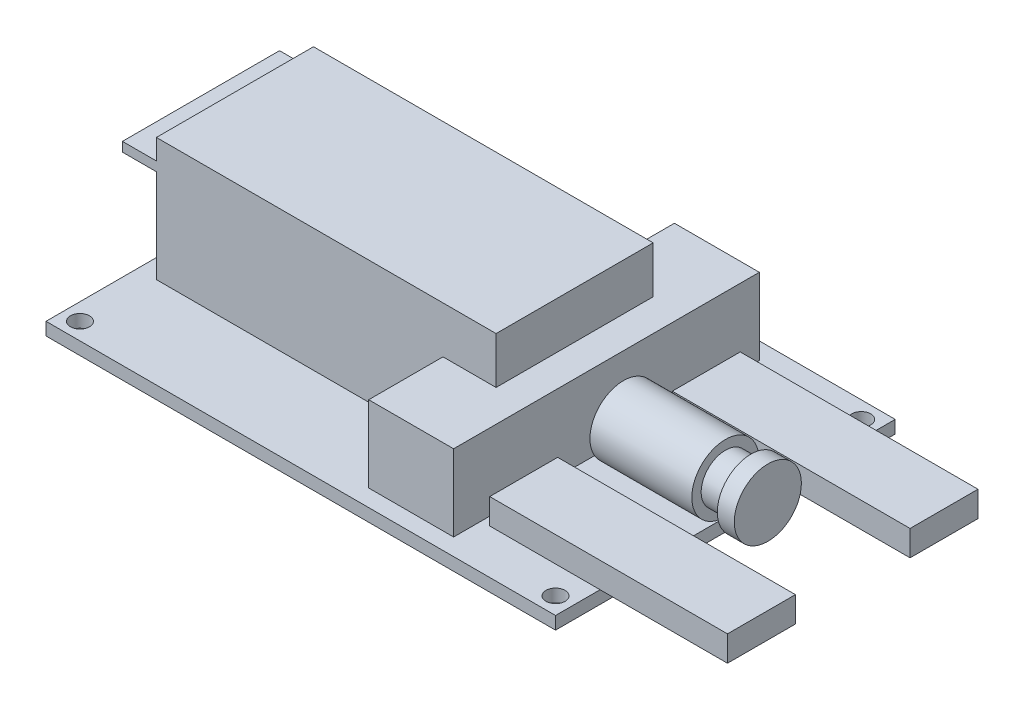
ISO-10303-21;
HEADER;
FILE_DESCRIPTION(('STEP AP214'),'2;1');
FILE_NAME('part.step','',(''),(''),'','','');
FILE_SCHEMA(('AUTOMOTIVE_DESIGN { 1 0 10303 214 1 1 1 1 }'));
ENDSEC;
DATA;
#1=APPLICATION_CONTEXT('core data for automotive mechanical design processes');
#2=APPLICATION_PROTOCOL_DEFINITION('international standard','automotive_design',2000,#1);
#3=PRODUCT_CONTEXT('',#1,'mechanical');
#4=PRODUCT('Part','Part','',(#3));
#5=PRODUCT_RELATED_PRODUCT_CATEGORY('part','',(#4));
#6=PRODUCT_DEFINITION_FORMATION('','',#4);
#7=PRODUCT_DEFINITION_CONTEXT('part definition',#1,'design');
#8=PRODUCT_DEFINITION('design','',#6,#7);
#9=PRODUCT_DEFINITION_SHAPE('','',#8);
#10=(LENGTH_UNIT() NAMED_UNIT(*) SI_UNIT(.MILLI.,.METRE.));
#11=(NAMED_UNIT(*) PLANE_ANGLE_UNIT() SI_UNIT($,.RADIAN.));
#12=(NAMED_UNIT(*) SI_UNIT($,.STERADIAN.) SOLID_ANGLE_UNIT());
#13=UNCERTAINTY_MEASURE_WITH_UNIT(LENGTH_MEASURE(1.E-05),#10,'distance_accuracy_value','');
#14=(GEOMETRIC_REPRESENTATION_CONTEXT(3) GLOBAL_UNCERTAINTY_ASSIGNED_CONTEXT((#13)) GLOBAL_UNIT_ASSIGNED_CONTEXT((#10,
#11,#12)) REPRESENTATION_CONTEXT('',''));
#15=CARTESIAN_POINT('',(0.,0.,0.));
#16=DIRECTION('',(0.,0.,1.));
#17=DIRECTION('',(1.,0.,0.));
#18=AXIS2_PLACEMENT_3D('',#15,#16,#17);
#19=CARTESIAN_POINT('',(17.,3.,-14.75));
#20=DIRECTION('',(0.,0.,-1.));
#21=DIRECTION('',(-1.,0.,0.));
#22=AXIS2_PLACEMENT_3D('',#19,#20,#21);
#23=PLANE('',#22);
#24=DIRECTION('',(1.,0.,0.));
#25=VECTOR('',#24,1.);
#26=CARTESIAN_POINT('',(17.,3.,-14.75));
#27=LINE('',#26,#25);
#28=CARTESIAN_POINT('',(17.,3.,-14.75));
#29=VERTEX_POINT('',#28);
#30=CARTESIAN_POINT('',(45.,3.,-14.75));
#31=VERTEX_POINT('',#30);
#32=EDGE_CURVE('E46',#29,#31,#27,.T.);
#33=ORIENTED_EDGE('',*,*,#32,.T.);
#34=DIRECTION('',(0.,1.,0.));
#35=VECTOR('',#34,1.);
#36=CARTESIAN_POINT('',(45.,3.,-14.75));
#37=LINE('',#36,#35);
#38=CARTESIAN_POINT('',(45.,0.,-14.75));
#39=VERTEX_POINT('',#38);
#40=EDGE_CURVE('E83',#39,#31,#37,.T.);
#41=ORIENTED_EDGE('',*,*,#40,.F.);
#42=DIRECTION('',(1.,0.,0.));
#43=VECTOR('',#42,1.);
#44=CARTESIAN_POINT('',(17.,0.,-14.75));
#45=LINE('',#44,#43);
#46=CARTESIAN_POINT('',(17.,0.,-14.75));
#47=VERTEX_POINT('',#46);
#48=EDGE_CURVE('E12',#47,#39,#45,.T.);
#49=ORIENTED_EDGE('',*,*,#48,.F.);
#50=DIRECTION('',(0.,1.,0.));
#51=VECTOR('',#50,1.);
#52=CARTESIAN_POINT('',(17.,3.,-14.75));
#53=LINE('',#52,#51);
#54=EDGE_CURVE('E84',#47,#29,#53,.T.);
#55=ORIENTED_EDGE('',*,*,#54,.T.);
#56=EDGE_LOOP('',(#33,#41,#49,#55));
#57=FACE_BOUND('',#56,.T.);
#58=ADVANCED_FACE('F43',(#57),#23,.T.);
#59=CARTESIAN_POINT('',(17.,0.,-14.75));
#60=DIRECTION('',(0.,-1.,0.));
#61=DIRECTION('',(0.,0.,-1.));
#62=AXIS2_PLACEMENT_3D('',#59,#60,#61);
#63=PLANE('',#62);
#64=ORIENTED_EDGE('',*,*,#48,.T.);
#65=DIRECTION('',(0.,0.,-1.));
#66=VECTOR('',#65,1.);
#67=CARTESIAN_POINT('',(45.,0.,-14.75));
#68=LINE('',#67,#66);
#69=CARTESIAN_POINT('',(45.,0.,-6.75));
#70=VERTEX_POINT('',#69);
#71=EDGE_CURVE('E100',#70,#39,#68,.T.);
#72=ORIENTED_EDGE('',*,*,#71,.F.);
#73=DIRECTION('',(1.,0.,0.));
#74=VECTOR('',#73,1.);
#75=CARTESIAN_POINT('',(17.,0.,-6.75));
#76=LINE('',#75,#74);
#77=CARTESIAN_POINT('',(17.,0.,-6.75));
#78=VERTEX_POINT('',#77);
#79=EDGE_CURVE('E51',#78,#70,#76,.T.);
#80=ORIENTED_EDGE('',*,*,#79,.F.);
#81=DIRECTION('',(0.,0.,-1.));
#82=VECTOR('',#81,1.);
#83=CARTESIAN_POINT('',(17.,0.,-14.75));
#84=LINE('',#83,#82);
#85=EDGE_CURVE('E89',#78,#47,#84,.T.);
#86=ORIENTED_EDGE('',*,*,#85,.T.);
#87=EDGE_LOOP('',(#64,#72,#80,#86));
#88=FACE_BOUND('',#87,.T.);
#89=ADVANCED_FACE('F115',(#88),#63,.T.);
#90=CARTESIAN_POINT('',(17.,3.,-6.75));
#91=DIRECTION('',(0.,0.,1.));
#92=DIRECTION('',(1.,0.,0.));
#93=AXIS2_PLACEMENT_3D('',#90,#91,#92);
#94=PLANE('',#93);
#95=ORIENTED_EDGE('',*,*,#79,.T.);
#96=DIRECTION('',(0.,-1.,0.));
#97=VECTOR('',#96,1.);
#98=CARTESIAN_POINT('',(45.,3.,-6.75));
#99=LINE('',#98,#97);
#100=CARTESIAN_POINT('',(45.,3.,-6.75));
#101=VERTEX_POINT('',#100);
#102=EDGE_CURVE('E96',#101,#70,#99,.T.);
#103=ORIENTED_EDGE('',*,*,#102,.F.);
#104=DIRECTION('',(1.,0.,0.));
#105=VECTOR('',#104,1.);
#106=CARTESIAN_POINT('',(17.,3.,-6.75));
#107=LINE('',#106,#105);
#108=CARTESIAN_POINT('',(17.,3.,-6.75));
#109=VERTEX_POINT('',#108);
#110=EDGE_CURVE('E88',#109,#101,#107,.T.);
#111=ORIENTED_EDGE('',*,*,#110,.F.);
#112=DIRECTION('',(0.,-1.,0.));
#113=VECTOR('',#112,1.);
#114=CARTESIAN_POINT('',(17.,3.,-6.75));
#115=LINE('',#114,#113);
#116=EDGE_CURVE('E108',#109,#78,#115,.T.);
#117=ORIENTED_EDGE('',*,*,#116,.T.);
#118=EDGE_LOOP('',(#95,#103,#111,#117));
#119=FACE_BOUND('',#118,.T.);
#120=ADVANCED_FACE('F112',(#119),#94,.T.);
#121=CARTESIAN_POINT('',(17.,3.,-14.75));
#122=DIRECTION('',(0.,1.,0.));
#123=DIRECTION('',(0.,0.,1.));
#124=AXIS2_PLACEMENT_3D('',#121,#122,#123);
#125=PLANE('',#124);
#126=ORIENTED_EDGE('',*,*,#110,.T.);
#127=DIRECTION('',(0.,0.,1.));
#128=VECTOR('',#127,1.);
#129=CARTESIAN_POINT('',(45.,3.,-14.75));
#130=LINE('',#129,#128);
#131=EDGE_CURVE('E91',#31,#101,#130,.T.);
#132=ORIENTED_EDGE('',*,*,#131,.F.);
#133=ORIENTED_EDGE('',*,*,#32,.F.);
#134=DIRECTION('',(0.,0.,1.));
#135=VECTOR('',#134,1.);
#136=CARTESIAN_POINT('',(17.,3.,-14.75));
#137=LINE('',#136,#135);
#138=EDGE_CURVE('E106',#29,#109,#137,.T.);
#139=ORIENTED_EDGE('',*,*,#138,.T.);
#140=EDGE_LOOP('',(#126,#132,#133,#139));
#141=FACE_BOUND('',#140,.T.);
#142=ADVANCED_FACE('F92',(#141),#125,.T.);
#143=CARTESIAN_POINT('',(17.,0.,0.));
#144=DIRECTION('',(-1.,0.,0.));
#145=DIRECTION('',(0.,0.,1.));
#146=AXIS2_PLACEMENT_3D('',#143,#144,#145);
#147=PLANE('',#146);
#148=ORIENTED_EDGE('',*,*,#54,.F.);
#149=ORIENTED_EDGE('',*,*,#85,.F.);
#150=ORIENTED_EDGE('',*,*,#116,.F.);
#151=ORIENTED_EDGE('',*,*,#138,.F.);
#152=EDGE_LOOP('',(#148,#149,#150,#151));
#153=FACE_BOUND('',#152,.T.);
#154=ADVANCED_FACE('F117',(#153),#147,.T.);
#155=CARTESIAN_POINT('',(45.,0.,0.));
#156=DIRECTION('',(-1.,0.,0.));
#157=DIRECTION('',(0.,0.,1.));
#158=AXIS2_PLACEMENT_3D('',#155,#156,#157);
#159=PLANE('',#158);
#160=ORIENTED_EDGE('',*,*,#40,.T.);
#161=ORIENTED_EDGE('',*,*,#131,.T.);
#162=ORIENTED_EDGE('',*,*,#102,.T.);
#163=ORIENTED_EDGE('',*,*,#71,.T.);
#164=EDGE_LOOP('',(#160,#161,#162,#163));
#165=FACE_BOUND('',#164,.T.);
#166=ADVANCED_FACE('F99',(#165),#159,.F.);
#167=CLOSED_SHELL('',(#58,#89,#120,#142,#154,#166));
#168=MANIFOLD_SOLID_BREP('B2',#167);
#169=CARTESIAN_POINT('',(17.,3.,14.75));
#170=DIRECTION('',(0.,0.,1.));
#171=DIRECTION('',(1.,0.,0.));
#172=AXIS2_PLACEMENT_3D('',#169,#170,#171);
#173=PLANE('',#172);
#174=DIRECTION('',(1.,0.,0.));
#175=VECTOR('',#174,1.);
#176=CARTESIAN_POINT('',(17.,0.,14.75));
#177=LINE('',#176,#175);
#178=CARTESIAN_POINT('',(17.,0.,14.75));
#179=VERTEX_POINT('',#178);
#180=CARTESIAN_POINT('',(45.,0.,14.75));
#181=VERTEX_POINT('',#180);
#182=EDGE_CURVE('E177',#179,#181,#177,.T.);
#183=ORIENTED_EDGE('',*,*,#182,.T.);
#184=DIRECTION('',(0.,-1.,0.));
#185=VECTOR('',#184,1.);
#186=CARTESIAN_POINT('',(45.,3.,14.75));
#187=LINE('',#186,#185);
#188=CARTESIAN_POINT('',(45.,3.,14.75));
#189=VERTEX_POINT('',#188);
#190=EDGE_CURVE('E214',#189,#181,#187,.T.);
#191=ORIENTED_EDGE('',*,*,#190,.F.);
#192=DIRECTION('',(1.,0.,0.));
#193=VECTOR('',#192,1.);
#194=CARTESIAN_POINT('',(17.,3.,14.75));
#195=LINE('',#194,#193);
#196=CARTESIAN_POINT('',(17.,3.,14.75));
#197=VERTEX_POINT('',#196);
#198=EDGE_CURVE('E41',#197,#189,#195,.T.);
#199=ORIENTED_EDGE('',*,*,#198,.F.);
#200=DIRECTION('',(0.,-1.,0.));
#201=VECTOR('',#200,1.);
#202=CARTESIAN_POINT('',(17.,3.,14.75));
#203=LINE('',#202,#201);
#204=EDGE_CURVE('E215',#197,#179,#203,.T.);
#205=ORIENTED_EDGE('',*,*,#204,.T.);
#206=EDGE_LOOP('',(#183,#191,#199,#205));
#207=FACE_BOUND('',#206,.T.);
#208=ADVANCED_FACE('F174',(#207),#173,.T.);
#209=CARTESIAN_POINT('',(17.,3.,14.75));
#210=DIRECTION('',(0.,1.,0.));
#211=DIRECTION('',(0.,0.,1.));
#212=AXIS2_PLACEMENT_3D('',#209,#210,#211);
#213=PLANE('',#212);
#214=ORIENTED_EDGE('',*,*,#198,.T.);
#215=DIRECTION('',(0.,0.,1.));
#216=VECTOR('',#215,1.);
#217=CARTESIAN_POINT('',(45.,3.,14.75));
#218=LINE('',#217,#216);
#219=CARTESIAN_POINT('',(45.,3.,6.75));
#220=VERTEX_POINT('',#219);
#221=EDGE_CURVE('E231',#220,#189,#218,.T.);
#222=ORIENTED_EDGE('',*,*,#221,.F.);
#223=DIRECTION('',(1.,0.,0.));
#224=VECTOR('',#223,1.);
#225=CARTESIAN_POINT('',(17.,3.,6.75));
#226=LINE('',#225,#224);
#227=CARTESIAN_POINT('',(17.,3.,6.75));
#228=VERTEX_POINT('',#227);
#229=EDGE_CURVE('E182',#228,#220,#226,.T.);
#230=ORIENTED_EDGE('',*,*,#229,.F.);
#231=DIRECTION('',(0.,0.,1.));
#232=VECTOR('',#231,1.);
#233=CARTESIAN_POINT('',(17.,3.,14.75));
#234=LINE('',#233,#232);
#235=EDGE_CURVE('E220',#228,#197,#234,.T.);
#236=ORIENTED_EDGE('',*,*,#235,.T.);
#237=EDGE_LOOP('',(#214,#222,#230,#236));
#238=FACE_BOUND('',#237,.T.);
#239=ADVANCED_FACE('F246',(#238),#213,.T.);
#240=CARTESIAN_POINT('',(17.,3.,6.75));
#241=DIRECTION('',(0.,0.,-1.));
#242=DIRECTION('',(-1.,0.,0.));
#243=AXIS2_PLACEMENT_3D('',#240,#241,#242);
#244=PLANE('',#243);
#245=ORIENTED_EDGE('',*,*,#229,.T.);
#246=DIRECTION('',(0.,1.,0.));
#247=VECTOR('',#246,1.);
#248=CARTESIAN_POINT('',(45.,3.,6.75));
#249=LINE('',#248,#247);
#250=CARTESIAN_POINT('',(45.,0.,6.75));
#251=VERTEX_POINT('',#250);
#252=EDGE_CURVE('E227',#251,#220,#249,.T.);
#253=ORIENTED_EDGE('',*,*,#252,.F.);
#254=DIRECTION('',(1.,0.,0.));
#255=VECTOR('',#254,1.);
#256=CARTESIAN_POINT('',(17.,0.,6.75));
#257=LINE('',#256,#255);
#258=CARTESIAN_POINT('',(17.,0.,6.75));
#259=VERTEX_POINT('',#258);
#260=EDGE_CURVE('E219',#259,#251,#257,.T.);
#261=ORIENTED_EDGE('',*,*,#260,.F.);
#262=DIRECTION('',(0.,1.,0.));
#263=VECTOR('',#262,1.);
#264=CARTESIAN_POINT('',(17.,3.,6.75));
#265=LINE('',#264,#263);
#266=EDGE_CURVE('E239',#259,#228,#265,.T.);
#267=ORIENTED_EDGE('',*,*,#266,.T.);
#268=EDGE_LOOP('',(#245,#253,#261,#267));
#269=FACE_BOUND('',#268,.T.);
#270=ADVANCED_FACE('F243',(#269),#244,.T.);
#271=CARTESIAN_POINT('',(17.,0.,14.75));
#272=DIRECTION('',(0.,-1.,0.));
#273=DIRECTION('',(0.,0.,-1.));
#274=AXIS2_PLACEMENT_3D('',#271,#272,#273);
#275=PLANE('',#274);
#276=ORIENTED_EDGE('',*,*,#260,.T.);
#277=DIRECTION('',(0.,0.,-1.));
#278=VECTOR('',#277,1.);
#279=CARTESIAN_POINT('',(45.,0.,14.75));
#280=LINE('',#279,#278);
#281=EDGE_CURVE('E222',#181,#251,#280,.T.);
#282=ORIENTED_EDGE('',*,*,#281,.F.);
#283=ORIENTED_EDGE('',*,*,#182,.F.);
#284=DIRECTION('',(0.,0.,-1.));
#285=VECTOR('',#284,1.);
#286=CARTESIAN_POINT('',(17.,0.,14.75));
#287=LINE('',#286,#285);
#288=EDGE_CURVE('E237',#179,#259,#287,.T.);
#289=ORIENTED_EDGE('',*,*,#288,.T.);
#290=EDGE_LOOP('',(#276,#282,#283,#289));
#291=FACE_BOUND('',#290,.T.);
#292=ADVANCED_FACE('F223',(#291),#275,.T.);
#293=CARTESIAN_POINT('',(17.,0.,0.));
#294=DIRECTION('',(1.,0.,0.));
#295=DIRECTION('',(0.,0.,-1.));
#296=AXIS2_PLACEMENT_3D('',#293,#294,#295);
#297=PLANE('',#296);
#298=ORIENTED_EDGE('',*,*,#204,.F.);
#299=ORIENTED_EDGE('',*,*,#235,.F.);
#300=ORIENTED_EDGE('',*,*,#266,.F.);
#301=ORIENTED_EDGE('',*,*,#288,.F.);
#302=EDGE_LOOP('',(#298,#299,#300,#301));
#303=FACE_BOUND('',#302,.T.);
#304=ADVANCED_FACE('F248',(#303),#297,.F.);
#305=CARTESIAN_POINT('',(45.,0.,0.));
#306=DIRECTION('',(1.,0.,0.));
#307=DIRECTION('',(0.,0.,-1.));
#308=AXIS2_PLACEMENT_3D('',#305,#306,#307);
#309=PLANE('',#308);
#310=ORIENTED_EDGE('',*,*,#190,.T.);
#311=ORIENTED_EDGE('',*,*,#281,.T.);
#312=ORIENTED_EDGE('',*,*,#252,.T.);
#313=ORIENTED_EDGE('',*,*,#221,.T.);
#314=EDGE_LOOP('',(#310,#311,#312,#313));
#315=FACE_BOUND('',#314,.T.);
#316=ADVANCED_FACE('F230',(#315),#309,.T.);
#317=CLOSED_SHELL('',(#208,#239,#270,#292,#304,#316));
#318=MANIFOLD_SOLID_BREP('B6',#317);
#319=CARTESIAN_POINT('',(35.,4.,0.));
#320=DIRECTION('',(-1.,0.,0.));
#321=DIRECTION('',(0.,0.,1.));
#322=AXIS2_PLACEMENT_3D('',#319,#320,#321);
#323=CYLINDRICAL_SURFACE('',#322,3.95);
#324=CARTESIAN_POINT('',(35.,4.,0.));
#325=DIRECTION('',(1.,0.,0.));
#326=DIRECTION('',(0.,0.,-1.));
#327=AXIS2_PLACEMENT_3D('',#324,#325,#326);
#328=CIRCLE('',#327,3.95);
#329=CARTESIAN_POINT('',(35.,4.,-3.95));
#330=VERTEX_POINT('',#329);
#331=EDGE_CURVE('E173',#330,#330,#328,.T.);
#332=ORIENTED_EDGE('',*,*,#331,.F.);
#333=EDGE_LOOP('',(#332));
#334=FACE_BOUND('',#333,.T.);
#335=CARTESIAN_POINT('',(33.,4.,0.));
#336=DIRECTION('',(1.,0.,0.));
#337=DIRECTION('',(0.,0.,-1.));
#338=AXIS2_PLACEMENT_3D('',#335,#336,#337);
#339=CIRCLE('',#338,3.95);
#340=CARTESIAN_POINT('',(33.,4.,-3.95));
#341=VERTEX_POINT('',#340);
#342=EDGE_CURVE('E308',#341,#341,#339,.T.);
#343=ORIENTED_EDGE('',*,*,#342,.T.);
#344=EDGE_LOOP('',(#343));
#345=FACE_BOUND('',#344,.T.);
#346=ADVANCED_FACE('F305',(#334,#345),#323,.T.);
#347=CARTESIAN_POINT('',(35.,4.,0.));
#348=DIRECTION('',(1.,0.,0.));
#349=DIRECTION('',(0.,0.,-1.));
#350=AXIS2_PLACEMENT_3D('',#347,#348,#349);
#351=PLANE('',#350);
#352=ORIENTED_EDGE('',*,*,#331,.T.);
#353=EDGE_LOOP('',(#352));
#354=FACE_BOUND('',#353,.T.);
#355=ADVANCED_FACE('F320',(#354),#351,.T.);
#356=CARTESIAN_POINT('',(33.,4.,0.));
#357=DIRECTION('',(1.,0.,0.));
#358=DIRECTION('',(0.,0.,-1.));
#359=AXIS2_PLACEMENT_3D('',#356,#357,#358);
#360=PLANE('',#359);
#361=ORIENTED_EDGE('',*,*,#342,.F.);
#362=EDGE_LOOP('',(#361));
#363=FACE_BOUND('',#362,.T.);
#364=ADVANCED_FACE('F318',(#363),#360,.F.);
#365=CLOSED_SHELL('',(#346,#355,#364));
#366=MANIFOLD_SOLID_BREP('B35',#365);
#367=CARTESIAN_POINT('',(33.,4.,0.));
#368=DIRECTION('',(-1.,0.,0.));
#369=DIRECTION('',(0.,0.,1.));
#370=AXIS2_PLACEMENT_3D('',#367,#368,#369);
#371=CYLINDRICAL_SURFACE('',#370,2.85);
#372=CARTESIAN_POINT('',(33.,4.,0.));
#373=DIRECTION('',(1.,0.,0.));
#374=DIRECTION('',(0.,0.,-1.));
#375=AXIS2_PLACEMENT_3D('',#372,#373,#374);
#376=CIRCLE('',#375,2.85);
#377=CARTESIAN_POINT('',(33.,4.,-2.85));
#378=VERTEX_POINT('',#377);
#379=EDGE_CURVE('E304',#378,#378,#376,.T.);
#380=ORIENTED_EDGE('',*,*,#379,.F.);
#381=EDGE_LOOP('',(#380));
#382=FACE_BOUND('',#381,.T.);
#383=CARTESIAN_POINT('',(30.,4.,0.));
#384=DIRECTION('',(1.,0.,0.));
#385=DIRECTION('',(0.,0.,-1.));
#386=AXIS2_PLACEMENT_3D('',#383,#384,#385);
#387=CIRCLE('',#386,2.85);
#388=CARTESIAN_POINT('',(30.,4.,-2.85));
#389=VERTEX_POINT('',#388);
#390=EDGE_CURVE('E356',#389,#389,#387,.T.);
#391=ORIENTED_EDGE('',*,*,#390,.T.);
#392=EDGE_LOOP('',(#391));
#393=FACE_BOUND('',#392,.T.);
#394=ADVANCED_FACE('F353',(#382,#393),#371,.T.);
#395=CARTESIAN_POINT('',(33.,4.,0.));
#396=DIRECTION('',(1.,0.,0.));
#397=DIRECTION('',(0.,0.,-1.));
#398=AXIS2_PLACEMENT_3D('',#395,#396,#397);
#399=PLANE('',#398);
#400=ORIENTED_EDGE('',*,*,#379,.T.);
#401=EDGE_LOOP('',(#400));
#402=FACE_BOUND('',#401,.T.);
#403=ADVANCED_FACE('F368',(#402),#399,.T.);
#404=CARTESIAN_POINT('',(30.,4.,0.));
#405=DIRECTION('',(1.,0.,0.));
#406=DIRECTION('',(0.,0.,-1.));
#407=AXIS2_PLACEMENT_3D('',#404,#405,#406);
#408=PLANE('',#407);
#409=ORIENTED_EDGE('',*,*,#390,.F.);
#410=EDGE_LOOP('',(#409));
#411=FACE_BOUND('',#410,.T.);
#412=ADVANCED_FACE('F366',(#411),#408,.F.);
#413=CLOSED_SHELL('',(#394,#403,#412));
#414=MANIFOLD_SOLID_BREP('B168',#413);
#415=CARTESIAN_POINT('',(18.,4.,0.));
#416=DIRECTION('',(1.,0.,0.));
#417=DIRECTION('',(0.,0.,-1.));
#418=AXIS2_PLACEMENT_3D('',#415,#416,#417);
#419=CYLINDRICAL_SURFACE('',#418,3.95);
#420=CARTESIAN_POINT('',(18.,4.,0.));
#421=DIRECTION('',(1.,0.,0.));
#422=DIRECTION('',(0.,0.,-1.));
#423=AXIS2_PLACEMENT_3D('',#420,#421,#422);
#424=CIRCLE('',#423,3.95);
#425=CARTESIAN_POINT('',(18.,4.,-3.95));
#426=VERTEX_POINT('',#425);
#427=EDGE_CURVE('E352',#426,#426,#424,.T.);
#428=ORIENTED_EDGE('',*,*,#427,.T.);
#429=EDGE_LOOP('',(#428));
#430=FACE_BOUND('',#429,.T.);
#431=CARTESIAN_POINT('',(30.,4.,0.));
#432=DIRECTION('',(1.,0.,0.));
#433=DIRECTION('',(0.,0.,-1.));
#434=AXIS2_PLACEMENT_3D('',#431,#432,#433);
#435=CIRCLE('',#434,3.95);
#436=CARTESIAN_POINT('',(30.,4.,-3.95));
#437=VERTEX_POINT('',#436);
#438=EDGE_CURVE('E405',#437,#437,#435,.T.);
#439=ORIENTED_EDGE('',*,*,#438,.F.);
#440=EDGE_LOOP('',(#439));
#441=FACE_BOUND('',#440,.T.);
#442=ADVANCED_FACE('F402',(#430,#441),#419,.T.);
#443=CARTESIAN_POINT('',(18.,4.,0.));
#444=DIRECTION('',(1.,0.,0.));
#445=DIRECTION('',(0.,0.,-1.));
#446=AXIS2_PLACEMENT_3D('',#443,#444,#445);
#447=PLANE('',#446);
#448=ORIENTED_EDGE('',*,*,#427,.F.);
#449=EDGE_LOOP('',(#448));
#450=FACE_BOUND('',#449,.T.);
#451=ADVANCED_FACE('F417',(#450),#447,.F.);
#452=CARTESIAN_POINT('',(30.,4.,0.));
#453=DIRECTION('',(1.,0.,0.));
#454=DIRECTION('',(0.,0.,-1.));
#455=AXIS2_PLACEMENT_3D('',#452,#453,#454);
#456=PLANE('',#455);
#457=ORIENTED_EDGE('',*,*,#438,.T.);
#458=EDGE_LOOP('',(#457));
#459=FACE_BOUND('',#458,.T.);
#460=ADVANCED_FACE('F414',(#459),#456,.T.);
#461=CLOSED_SHELL('',(#442,#451,#460));
#462=MANIFOLD_SOLID_BREP('B299',#461);
#463=CARTESIAN_POINT('',(0.,14.5,0.));
#464=DIRECTION('',(0.,1.,0.));
#465=DIRECTION('',(0.,0.,1.));
#466=AXIS2_PLACEMENT_3D('',#463,#464,#465);
#467=PLANE('',#466);
#468=DIRECTION('',(-1.,0.,0.));
#469=VECTOR('',#468,1.);
#470=CARTESIAN_POINT('',(-31.75,14.5,-9.25));
#471=LINE('',#470,#469);
#472=CARTESIAN_POINT('',(12.25,14.5,-9.25));
#473=VERTEX_POINT('',#472);
#474=CARTESIAN_POINT('',(-27.75,14.5,-9.25));
#475=VERTEX_POINT('',#474);
#476=EDGE_CURVE('E617',#473,#475,#471,.T.);
#477=ORIENTED_EDGE('',*,*,#476,.T.);
#478=DIRECTION('',(0.,0.,-1.));
#479=VECTOR('',#478,1.);
#480=CARTESIAN_POINT('',(-27.75,14.5,-9.25));
#481=LINE('',#480,#479);
#482=CARTESIAN_POINT('',(-27.75,14.5,9.25));
#483=VERTEX_POINT('',#482);
#484=EDGE_CURVE('E579',#483,#475,#481,.T.);
#485=ORIENTED_EDGE('',*,*,#484,.F.);
#486=DIRECTION('',(1.,0.,0.));
#487=VECTOR('',#486,1.);
#488=CARTESIAN_POINT('',(-31.75,14.5,9.25));
#489=LINE('',#488,#487);
#490=CARTESIAN_POINT('',(12.25,14.5,9.24999999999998));
#491=VERTEX_POINT('',#490);
#492=EDGE_CURVE('E612',#483,#491,#489,.T.);
#493=ORIENTED_EDGE('',*,*,#492,.T.);
#494=DIRECTION('',(0.,0.,-1.));
#495=VECTOR('',#494,1.);
#496=CARTESIAN_POINT('',(12.25,14.5,-9.25));
#497=LINE('',#496,#495);
#498=EDGE_CURVE('E614',#491,#473,#497,.T.);
#499=ORIENTED_EDGE('',*,*,#498,.T.);
#500=EDGE_LOOP('',(#477,#485,#493,#499));
#501=FACE_BOUND('',#500,.T.);
#502=ADVANCED_FACE('F442',(#501),#467,.T.);
#503=CARTESIAN_POINT('',(0.,0.,0.));
#504=DIRECTION('',(0.,-1.,0.));
#505=DIRECTION('',(0.,0.,-1.));
#506=AXIS2_PLACEMENT_3D('',#503,#504,#505);
#507=PLANE('',#506);
#508=DIRECTION('',(1.,0.,0.));
#509=VECTOR('',#508,1.);
#510=CARTESIAN_POINT('',(-31.75,0.,9.25));
#511=LINE('',#510,#509);
#512=CARTESIAN_POINT('',(-27.75,0.,9.25));
#513=VERTEX_POINT('',#512);
#514=CARTESIAN_POINT('',(6.00000000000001,0.,9.24999999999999));
#515=VERTEX_POINT('',#514);
#516=EDGE_CURVE('E610',#513,#515,#511,.T.);
#517=ORIENTED_EDGE('',*,*,#516,.F.);
#518=DIRECTION('',(0.,0.,1.));
#519=VECTOR('',#518,1.);
#520=CARTESIAN_POINT('',(-27.75,0.,-9.25));
#521=LINE('',#520,#519);
#522=CARTESIAN_POINT('',(-27.75,0.,-9.25));
#523=VERTEX_POINT('',#522);
#524=EDGE_CURVE('E598',#523,#513,#521,.T.);
#525=ORIENTED_EDGE('',*,*,#524,.F.);
#526=DIRECTION('',(-1.,0.,0.));
#527=VECTOR('',#526,1.);
#528=CARTESIAN_POINT('',(-31.75,0.,-9.25));
#529=LINE('',#528,#527);
#530=CARTESIAN_POINT('',(6.,0.,-9.25));
#531=VERTEX_POINT('',#530);
#532=EDGE_CURVE('E615',#531,#523,#529,.T.);
#533=ORIENTED_EDGE('',*,*,#532,.F.);
#534=DIRECTION('',(0.,0.,1.));
#535=VECTOR('',#534,1.);
#536=CARTESIAN_POINT('',(6.,0.,-18.));
#537=LINE('',#536,#535);
#538=CARTESIAN_POINT('',(6.,0.,-18.));
#539=VERTEX_POINT('',#538);
#540=EDGE_CURVE('E645',#539,#531,#537,.T.);
#541=ORIENTED_EDGE('',*,*,#540,.F.);
#542=DIRECTION('',(-1.,0.,0.));
#543=VECTOR('',#542,1.);
#544=CARTESIAN_POINT('',(6.,0.,-18.));
#545=LINE('',#544,#543);
#546=CARTESIAN_POINT('',(16.,0.,-18.));
#547=VERTEX_POINT('',#546);
#548=EDGE_CURVE('E654',#547,#539,#545,.T.);
#549=ORIENTED_EDGE('',*,*,#548,.F.);
#550=DIRECTION('',(0.,0.,-1.));
#551=VECTOR('',#550,1.);
#552=CARTESIAN_POINT('',(16.,0.,-18.));
#553=LINE('',#552,#551);
#554=CARTESIAN_POINT('',(16.,0.,18.));
#555=VERTEX_POINT('',#554);
#556=EDGE_CURVE('E651',#555,#547,#553,.T.);
#557=ORIENTED_EDGE('',*,*,#556,.F.);
#558=DIRECTION('',(1.,0.,0.));
#559=VECTOR('',#558,1.);
#560=CARTESIAN_POINT('',(6.,0.,18.));
#561=LINE('',#560,#559);
#562=CARTESIAN_POINT('',(6.,0.,18.));
#563=VERTEX_POINT('',#562);
#564=EDGE_CURVE('E648',#563,#555,#561,.T.);
#565=ORIENTED_EDGE('',*,*,#564,.F.);
#566=EDGE_CURVE('E633',#515,#563,#537,.T.);
#567=ORIENTED_EDGE('',*,*,#566,.F.);
#568=EDGE_LOOP('',(#517,#525,#533,#541,#549,#557,#565,#567));
#569=FACE_BOUND('',#568,.T.);
#570=CARTESIAN_POINT('',(28.,0.,18.));
#571=DIRECTION('',(0.,1.,0.));
#572=DIRECTION('',(0.,0.,1.));
#573=AXIS2_PLACEMENT_3D('',#570,#571,#572);
#574=CIRCLE('',#573,1.125);
#575=CARTESIAN_POINT('',(28.,0.,19.125));
#576=VERTEX_POINT('',#575);
#577=EDGE_CURVE('E668',#576,#576,#574,.T.);
#578=ORIENTED_EDGE('',*,*,#577,.F.);
#579=EDGE_LOOP('',(#578));
#580=FACE_BOUND('',#579,.T.);
#581=CARTESIAN_POINT('',(-28.,0.,18.));
#582=DIRECTION('',(0.,1.,0.));
#583=DIRECTION('',(0.,0.,-1.));
#584=AXIS2_PLACEMENT_3D('',#581,#582,#583);
#585=CIRCLE('',#584,1.125);
#586=CARTESIAN_POINT('',(-28.,0.,16.875));
#587=VERTEX_POINT('',#586);
#588=EDGE_CURVE('E672',#587,#587,#585,.T.);
#589=ORIENTED_EDGE('',*,*,#588,.F.);
#590=EDGE_LOOP('',(#589));
#591=FACE_BOUND('',#590,.T.);
#592=CARTESIAN_POINT('',(28.,0.,-18.));
#593=DIRECTION('',(0.,1.,0.));
#594=DIRECTION('',(0.,0.,-1.));
#595=AXIS2_PLACEMENT_3D('',#592,#593,#594);
#596=CIRCLE('',#595,1.125);
#597=CARTESIAN_POINT('',(28.,0.,-19.125));
#598=VERTEX_POINT('',#597);
#599=EDGE_CURVE('E678',#598,#598,#596,.T.);
#600=ORIENTED_EDGE('',*,*,#599,.F.);
#601=EDGE_LOOP('',(#600));
#602=FACE_BOUND('',#601,.T.);
#603=CARTESIAN_POINT('',(-28.,0.,-18.));
#604=DIRECTION('',(0.,1.,0.));
#605=DIRECTION('',(0.,0.,1.));
#606=AXIS2_PLACEMENT_3D('',#603,#604,#605);
#607=CIRCLE('',#606,1.125);
#608=CARTESIAN_POINT('',(-28.,0.,-16.875));
#609=VERTEX_POINT('',#608);
#610=EDGE_CURVE('E684',#609,#609,#607,.T.);
#611=ORIENTED_EDGE('',*,*,#610,.F.);
#612=EDGE_LOOP('',(#611));
#613=FACE_BOUND('',#612,.T.);
#614=DIRECTION('',(0.,0.,1.));
#615=VECTOR('',#614,1.);
#616=CARTESIAN_POINT('',(-30.,0.,20.));
#617=LINE('',#616,#615);
#618=CARTESIAN_POINT('',(-30.,0.,-20.));
#619=VERTEX_POINT('',#618);
#620=CARTESIAN_POINT('',(-30.,0.,20.));
#621=VERTEX_POINT('',#620);
#622=EDGE_CURVE('E712',#619,#621,#617,.T.);
#623=ORIENTED_EDGE('',*,*,#622,.T.);
#624=DIRECTION('',(1.,0.,0.));
#625=VECTOR('',#624,1.);
#626=CARTESIAN_POINT('',(-30.,0.,20.));
#627=LINE('',#626,#625);
#628=CARTESIAN_POINT('',(30.,0.,20.));
#629=VERTEX_POINT('',#628);
#630=EDGE_CURVE('E697',#621,#629,#627,.T.);
#631=ORIENTED_EDGE('',*,*,#630,.T.);
#632=DIRECTION('',(0.,0.,-1.));
#633=VECTOR('',#632,1.);
#634=CARTESIAN_POINT('',(30.,0.,20.));
#635=LINE('',#634,#633);
#636=CARTESIAN_POINT('',(30.,0.,-20.));
#637=VERTEX_POINT('',#636);
#638=EDGE_CURVE('E690',#629,#637,#635,.T.);
#639=ORIENTED_EDGE('',*,*,#638,.T.);
#640=DIRECTION('',(-1.,0.,0.));
#641=VECTOR('',#640,1.);
#642=CARTESIAN_POINT('',(-30.,0.,-20.));
#643=LINE('',#642,#641);
#644=EDGE_CURVE('E709',#637,#619,#643,.T.);
#645=ORIENTED_EDGE('',*,*,#644,.T.);
#646=EDGE_LOOP('',(#623,#631,#639,#645));
#647=FACE_BOUND('',#646,.T.);
#648=ADVANCED_FACE('F747',(#569,#580,#591,#602,#613,#647),#507,.F.);
#649=CARTESIAN_POINT('',(6.,9.,-18.));
#650=DIRECTION('',(1.,0.,0.));
#651=DIRECTION('',(0.,0.,-1.));
#652=AXIS2_PLACEMENT_3D('',#649,#650,#651);
#653=PLANE('',#652);
#654=DIRECTION('',(0.,1.,0.));
#655=VECTOR('',#654,1.);
#656=CARTESIAN_POINT('',(6.,9.,9.24999999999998));
#657=LINE('',#656,#655);
#658=CARTESIAN_POINT('',(6.,9.,9.24999999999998));
#659=VERTEX_POINT('',#658);
#660=EDGE_CURVE('E631',#515,#659,#657,.T.);
#661=ORIENTED_EDGE('',*,*,#660,.F.);
#662=ORIENTED_EDGE('',*,*,#566,.T.);
#663=DIRECTION('',(0.,-1.,0.));
#664=VECTOR('',#663,1.);
#665=CARTESIAN_POINT('',(6.,9.,18.));
#666=LINE('',#665,#664);
#667=CARTESIAN_POINT('',(6.,9.,18.));
#668=VERTEX_POINT('',#667);
#669=EDGE_CURVE('E665',#668,#563,#666,.T.);
#670=ORIENTED_EDGE('',*,*,#669,.F.);
#671=DIRECTION('',(0.,0.,1.));
#672=VECTOR('',#671,1.);
#673=CARTESIAN_POINT('',(6.,9.,-18.));
#674=LINE('',#673,#672);
#675=EDGE_CURVE('E638',#659,#668,#674,.T.);
#676=ORIENTED_EDGE('',*,*,#675,.F.);
#677=EDGE_LOOP('',(#661,#662,#670,#676));
#678=FACE_BOUND('',#677,.T.);
#679=ADVANCED_FACE('F743',(#678),#653,.F.);
#680=DIRECTION('',(0.,-1.,0.));
#681=VECTOR('',#680,1.);
#682=CARTESIAN_POINT('',(6.,9.,-9.25));
#683=LINE('',#682,#681);
#684=CARTESIAN_POINT('',(6.,9.,-9.25));
#685=VERTEX_POINT('',#684);
#686=EDGE_CURVE('E629',#685,#531,#683,.T.);
#687=ORIENTED_EDGE('',*,*,#686,.F.);
#688=CARTESIAN_POINT('',(6.,9.,-18.));
#689=VERTEX_POINT('',#688);
#690=EDGE_CURVE('E634',#689,#685,#674,.T.);
#691=ORIENTED_EDGE('',*,*,#690,.F.);
#692=DIRECTION('',(0.,-1.,0.));
#693=VECTOR('',#692,1.);
#694=CARTESIAN_POINT('',(6.,9.,-18.));
#695=LINE('',#694,#693);
#696=EDGE_CURVE('E644',#689,#539,#695,.T.);
#697=ORIENTED_EDGE('',*,*,#696,.T.);
#698=ORIENTED_EDGE('',*,*,#540,.T.);
#699=EDGE_LOOP('',(#687,#691,#697,#698));
#700=FACE_BOUND('',#699,.T.);
#701=ADVANCED_FACE('F764',(#700),#653,.F.);
#702=CARTESIAN_POINT('',(0.,9.,0.));
#703=DIRECTION('',(0.,1.,0.));
#704=DIRECTION('',(0.,0.,1.));
#705=AXIS2_PLACEMENT_3D('',#702,#703,#704);
#706=PLANE('',#705);
#707=DIRECTION('',(0.,0.,1.));
#708=VECTOR('',#707,1.);
#709=CARTESIAN_POINT('',(12.25,9.,0.));
#710=LINE('',#709,#708);
#711=CARTESIAN_POINT('',(12.25,9.,-9.25));
#712=VERTEX_POINT('',#711);
#713=CARTESIAN_POINT('',(12.25,9.,9.24999999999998));
#714=VERTEX_POINT('',#713);
#715=EDGE_CURVE('E450',#712,#714,#710,.T.);
#716=ORIENTED_EDGE('',*,*,#715,.T.);
#717=DIRECTION('',(-1.,0.,0.));
#718=VECTOR('',#717,1.);
#719=CARTESIAN_POINT('',(0.,9.,9.24999999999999));
#720=LINE('',#719,#718);
#721=EDGE_CURVE('E400',#714,#659,#720,.T.);
#722=ORIENTED_EDGE('',*,*,#721,.T.);
#723=ORIENTED_EDGE('',*,*,#675,.T.);
#724=DIRECTION('',(1.,0.,0.));
#725=VECTOR('',#724,1.);
#726=CARTESIAN_POINT('',(6.,9.,18.));
#727=LINE('',#726,#725);
#728=CARTESIAN_POINT('',(16.,9.,18.));
#729=VERTEX_POINT('',#728);
#730=EDGE_CURVE('E637',#668,#729,#727,.T.);
#731=ORIENTED_EDGE('',*,*,#730,.T.);
#732=DIRECTION('',(0.,0.,-1.));
#733=VECTOR('',#732,1.);
#734=CARTESIAN_POINT('',(16.,9.,-18.));
#735=LINE('',#734,#733);
#736=CARTESIAN_POINT('',(16.,9.,-18.));
#737=VERTEX_POINT('',#736);
#738=EDGE_CURVE('E640',#729,#737,#735,.T.);
#739=ORIENTED_EDGE('',*,*,#738,.T.);
#740=DIRECTION('',(-1.,0.,0.));
#741=VECTOR('',#740,1.);
#742=CARTESIAN_POINT('',(6.,9.,-18.));
#743=LINE('',#742,#741);
#744=EDGE_CURVE('E642',#737,#689,#743,.T.);
#745=ORIENTED_EDGE('',*,*,#744,.T.);
#746=ORIENTED_EDGE('',*,*,#690,.T.);
#747=DIRECTION('',(1.,0.,0.));
#748=VECTOR('',#747,1.);
#749=CARTESIAN_POINT('',(0.,9.,-9.25));
#750=LINE('',#749,#748);
#751=EDGE_CURVE('E718',#685,#712,#750,.T.);
#752=ORIENTED_EDGE('',*,*,#751,.T.);
#753=EDGE_LOOP('',(#716,#722,#723,#731,#739,#745,#746,#752));
#754=FACE_BOUND('',#753,.T.);
#755=ADVANCED_FACE('F729',(#754),#706,.T.);
#756=CARTESIAN_POINT('',(30.,-1.5,20.));
#757=DIRECTION('',(1.,0.,0.));
#758=DIRECTION('',(0.,0.,-1.));
#759=AXIS2_PLACEMENT_3D('',#756,#757,#758);
#760=PLANE('',#759);
#761=ORIENTED_EDGE('',*,*,#638,.F.);
#762=DIRECTION('',(0.,1.,0.));
#763=VECTOR('',#762,1.);
#764=CARTESIAN_POINT('',(30.,-1.5,20.));
#765=LINE('',#764,#763);
#766=CARTESIAN_POINT('',(30.,-1.5,20.));
#767=VERTEX_POINT('',#766);
#768=EDGE_CURVE('E716',#767,#629,#765,.T.);
#769=ORIENTED_EDGE('',*,*,#768,.F.);
#770=DIRECTION('',(0.,0.,-1.));
#771=VECTOR('',#770,1.);
#772=CARTESIAN_POINT('',(30.,-1.5,20.));
#773=LINE('',#772,#771);
#774=CARTESIAN_POINT('',(30.,-1.5,-20.));
#775=VERTEX_POINT('',#774);
#776=EDGE_CURVE('E693',#767,#775,#773,.T.);
#777=ORIENTED_EDGE('',*,*,#776,.T.);
#778=DIRECTION('',(0.,1.,0.));
#779=VECTOR('',#778,1.);
#780=CARTESIAN_POINT('',(30.,-1.5,-20.));
#781=LINE('',#780,#779);
#782=EDGE_CURVE('E706',#775,#637,#781,.T.);
#783=ORIENTED_EDGE('',*,*,#782,.T.);
#784=EDGE_LOOP('',(#761,#769,#777,#783));
#785=FACE_BOUND('',#784,.T.);
#786=ADVANCED_FACE('F444',(#785),#760,.T.);
#787=CARTESIAN_POINT('',(-30.,-1.5,20.));
#788=DIRECTION('',(0.,0.,1.));
#789=DIRECTION('',(1.,0.,0.));
#790=AXIS2_PLACEMENT_3D('',#787,#788,#789);
#791=PLANE('',#790);
#792=ORIENTED_EDGE('',*,*,#630,.F.);
#793=DIRECTION('',(0.,1.,0.));
#794=VECTOR('',#793,1.);
#795=CARTESIAN_POINT('',(-30.,-1.5,20.));
#796=LINE('',#795,#794);
#797=CARTESIAN_POINT('',(-30.,-1.5,20.));
#798=VERTEX_POINT('',#797);
#799=EDGE_CURVE('E719',#798,#621,#796,.T.);
#800=ORIENTED_EDGE('',*,*,#799,.F.);
#801=DIRECTION('',(1.,0.,0.));
#802=VECTOR('',#801,1.);
#803=CARTESIAN_POINT('',(-30.,-1.5,20.));
#804=LINE('',#803,#802);
#805=EDGE_CURVE('E703',#798,#767,#804,.T.);
#806=ORIENTED_EDGE('',*,*,#805,.T.);
#807=ORIENTED_EDGE('',*,*,#768,.T.);
#808=EDGE_LOOP('',(#792,#800,#806,#807));
#809=FACE_BOUND('',#808,.T.);
#810=ADVANCED_FACE('F830',(#809),#791,.T.);
#811=CARTESIAN_POINT('',(-30.,-1.5,20.));
#812=DIRECTION('',(-1.,0.,0.));
#813=DIRECTION('',(0.,0.,1.));
#814=AXIS2_PLACEMENT_3D('',#811,#812,#813);
#815=PLANE('',#814);
#816=ORIENTED_EDGE('',*,*,#622,.F.);
#817=DIRECTION('',(0.,1.,0.));
#818=VECTOR('',#817,1.);
#819=CARTESIAN_POINT('',(-30.,-1.5,-20.));
#820=LINE('',#819,#818);
#821=CARTESIAN_POINT('',(-30.,-1.5,-20.));
#822=VERTEX_POINT('',#821);
#823=EDGE_CURVE('E722',#822,#619,#820,.T.);
#824=ORIENTED_EDGE('',*,*,#823,.F.);
#825=DIRECTION('',(0.,0.,1.));
#826=VECTOR('',#825,1.);
#827=CARTESIAN_POINT('',(-30.,-1.5,20.));
#828=LINE('',#827,#826);
#829=EDGE_CURVE('E700',#822,#798,#828,.T.);
#830=ORIENTED_EDGE('',*,*,#829,.T.);
#831=ORIENTED_EDGE('',*,*,#799,.T.);
#832=EDGE_LOOP('',(#816,#824,#830,#831));
#833=FACE_BOUND('',#832,.T.);
#834=ADVANCED_FACE('F833',(#833),#815,.T.);
#835=CARTESIAN_POINT('',(-30.,-1.5,-20.));
#836=DIRECTION('',(0.,0.,-1.));
#837=DIRECTION('',(-1.,0.,0.));
#838=AXIS2_PLACEMENT_3D('',#835,#836,#837);
#839=PLANE('',#838);
#840=ORIENTED_EDGE('',*,*,#644,.F.);
#841=ORIENTED_EDGE('',*,*,#782,.F.);
#842=DIRECTION('',(-1.,0.,0.));
#843=VECTOR('',#842,1.);
#844=CARTESIAN_POINT('',(-30.,-1.5,-20.));
#845=LINE('',#844,#843);
#846=EDGE_CURVE('E696',#775,#822,#845,.T.);
#847=ORIENTED_EDGE('',*,*,#846,.T.);
#848=ORIENTED_EDGE('',*,*,#823,.T.);
#849=EDGE_LOOP('',(#840,#841,#847,#848));
#850=FACE_BOUND('',#849,.T.);
#851=ADVANCED_FACE('F827',(#850),#839,.T.);
#852=CARTESIAN_POINT('',(0.,-1.5,0.));
#853=DIRECTION('',(0.,-1.,0.));
#854=DIRECTION('',(0.,0.,-1.));
#855=AXIS2_PLACEMENT_3D('',#852,#853,#854);
#856=PLANE('',#855);
#857=CARTESIAN_POINT('',(28.,-1.5,18.));
#858=DIRECTION('',(0.,1.,0.));
#859=DIRECTION('',(0.,0.,1.));
#860=AXIS2_PLACEMENT_3D('',#857,#858,#859);
#861=CIRCLE('',#860,1.125);
#862=CARTESIAN_POINT('',(28.,-1.5,19.125));
#863=VERTEX_POINT('',#862);
#864=EDGE_CURVE('E669',#863,#863,#861,.T.);
#865=ORIENTED_EDGE('',*,*,#864,.T.);
#866=EDGE_LOOP('',(#865));
#867=FACE_BOUND('',#866,.T.);
#868=CARTESIAN_POINT('',(-28.,-1.5,18.));
#869=DIRECTION('',(0.,1.,0.));
#870=DIRECTION('',(0.,0.,-1.));
#871=AXIS2_PLACEMENT_3D('',#868,#869,#870);
#872=CIRCLE('',#871,1.125);
#873=CARTESIAN_POINT('',(-28.,-1.5,16.875));
#874=VERTEX_POINT('',#873);
#875=EDGE_CURVE('E675',#874,#874,#872,.T.);
#876=ORIENTED_EDGE('',*,*,#875,.T.);
#877=EDGE_LOOP('',(#876));
#878=FACE_BOUND('',#877,.T.);
#879=CARTESIAN_POINT('',(28.,-1.5,-18.));
#880=DIRECTION('',(0.,1.,0.));
#881=DIRECTION('',(0.,0.,-1.));
#882=AXIS2_PLACEMENT_3D('',#879,#880,#881);
#883=CIRCLE('',#882,1.125);
#884=CARTESIAN_POINT('',(28.,-1.5,-19.125));
#885=VERTEX_POINT('',#884);
#886=EDGE_CURVE('E681',#885,#885,#883,.T.);
#887=ORIENTED_EDGE('',*,*,#886,.T.);
#888=EDGE_LOOP('',(#887));
#889=FACE_BOUND('',#888,.T.);
#890=CARTESIAN_POINT('',(-28.,-1.5,-18.));
#891=DIRECTION('',(0.,1.,0.));
#892=DIRECTION('',(0.,0.,1.));
#893=AXIS2_PLACEMENT_3D('',#890,#891,#892);
#894=CIRCLE('',#893,1.125);
#895=CARTESIAN_POINT('',(-28.,-1.5,-16.875));
#896=VERTEX_POINT('',#895);
#897=EDGE_CURVE('E687',#896,#896,#894,.T.);
#898=ORIENTED_EDGE('',*,*,#897,.T.);
#899=EDGE_LOOP('',(#898));
#900=FACE_BOUND('',#899,.T.);
#901=ORIENTED_EDGE('',*,*,#776,.F.);
#902=ORIENTED_EDGE('',*,*,#805,.F.);
#903=ORIENTED_EDGE('',*,*,#829,.F.);
#904=ORIENTED_EDGE('',*,*,#846,.F.);
#905=EDGE_LOOP('',(#901,#902,#903,#904));
#906=FACE_BOUND('',#905,.T.);
#907=ADVANCED_FACE('F824',(#867,#878,#889,#900,#906),#856,.T.);
#908=CARTESIAN_POINT('',(-28.,-1.5,-18.));
#909=DIRECTION('',(0.,1.,0.));
#910=DIRECTION('',(0.,0.,1.));
#911=AXIS2_PLACEMENT_3D('',#908,#909,#910);
#912=CYLINDRICAL_SURFACE('',#911,1.125);
#913=ORIENTED_EDGE('',*,*,#897,.F.);
#914=EDGE_LOOP('',(#913));
#915=FACE_BOUND('',#914,.T.);
#916=ORIENTED_EDGE('',*,*,#610,.T.);
#917=EDGE_LOOP('',(#916));
#918=FACE_BOUND('',#917,.T.);
#919=ADVANCED_FACE('F820',(#915,#918),#912,.F.);
#920=CARTESIAN_POINT('',(28.,-1.5,-18.));
#921=DIRECTION('',(0.,1.,0.));
#922=DIRECTION('',(0.,0.,1.));
#923=AXIS2_PLACEMENT_3D('',#920,#921,#922);
#924=CYLINDRICAL_SURFACE('',#923,1.125);
#925=ORIENTED_EDGE('',*,*,#886,.F.);
#926=EDGE_LOOP('',(#925));
#927=FACE_BOUND('',#926,.T.);
#928=ORIENTED_EDGE('',*,*,#599,.T.);
#929=EDGE_LOOP('',(#928));
#930=FACE_BOUND('',#929,.T.);
#931=ADVANCED_FACE('F816',(#927,#930),#924,.F.);
#932=CARTESIAN_POINT('',(-28.,-1.5,18.));
#933=DIRECTION('',(0.,1.,0.));
#934=DIRECTION('',(0.,0.,1.));
#935=AXIS2_PLACEMENT_3D('',#932,#933,#934);
#936=CYLINDRICAL_SURFACE('',#935,1.125);
#937=ORIENTED_EDGE('',*,*,#875,.F.);
#938=EDGE_LOOP('',(#937));
#939=FACE_BOUND('',#938,.T.);
#940=ORIENTED_EDGE('',*,*,#588,.T.);
#941=EDGE_LOOP('',(#940));
#942=FACE_BOUND('',#941,.T.);
#943=ADVANCED_FACE('F812',(#939,#942),#936,.F.);
#944=CARTESIAN_POINT('',(28.,-1.5,18.));
#945=DIRECTION('',(0.,1.,0.));
#946=DIRECTION('',(0.,0.,1.));
#947=AXIS2_PLACEMENT_3D('',#944,#945,#946);
#948=CYLINDRICAL_SURFACE('',#947,1.125);
#949=ORIENTED_EDGE('',*,*,#864,.F.);
#950=EDGE_LOOP('',(#949));
#951=FACE_BOUND('',#950,.T.);
#952=ORIENTED_EDGE('',*,*,#577,.T.);
#953=EDGE_LOOP('',(#952));
#954=FACE_BOUND('',#953,.T.);
#955=ADVANCED_FACE('F807',(#951,#954),#948,.F.);
#956=CARTESIAN_POINT('',(6.,9.,18.));
#957=DIRECTION('',(0.,0.,-1.));
#958=DIRECTION('',(-1.,0.,0.));
#959=AXIS2_PLACEMENT_3D('',#956,#957,#958);
#960=PLANE('',#959);
#961=ORIENTED_EDGE('',*,*,#564,.T.);
#962=DIRECTION('',(0.,-1.,0.));
#963=VECTOR('',#962,1.);
#964=CARTESIAN_POINT('',(16.,9.,18.));
#965=LINE('',#964,#963);
#966=EDGE_CURVE('E662',#729,#555,#965,.T.);
#967=ORIENTED_EDGE('',*,*,#966,.F.);
#968=ORIENTED_EDGE('',*,*,#730,.F.);
#969=ORIENTED_EDGE('',*,*,#669,.T.);
#970=EDGE_LOOP('',(#961,#967,#968,#969));
#971=FACE_BOUND('',#970,.T.);
#972=ADVANCED_FACE('F752',(#971),#960,.F.);
#973=CARTESIAN_POINT('',(16.,9.,-18.));
#974=DIRECTION('',(-1.,0.,0.));
#975=DIRECTION('',(0.,0.,1.));
#976=AXIS2_PLACEMENT_3D('',#973,#974,#975);
#977=PLANE('',#976);
#978=ORIENTED_EDGE('',*,*,#556,.T.);
#979=DIRECTION('',(0.,-1.,0.));
#980=VECTOR('',#979,1.);
#981=CARTESIAN_POINT('',(16.,9.,-18.));
#982=LINE('',#981,#980);
#983=EDGE_CURVE('E659',#737,#547,#982,.T.);
#984=ORIENTED_EDGE('',*,*,#983,.F.);
#985=ORIENTED_EDGE('',*,*,#738,.F.);
#986=ORIENTED_EDGE('',*,*,#966,.T.);
#987=EDGE_LOOP('',(#978,#984,#985,#986));
#988=FACE_BOUND('',#987,.T.);
#989=ADVANCED_FACE('F758',(#988),#977,.F.);
#990=CARTESIAN_POINT('',(6.,9.,-18.));
#991=DIRECTION('',(0.,0.,1.));
#992=DIRECTION('',(1.,0.,0.));
#993=AXIS2_PLACEMENT_3D('',#990,#991,#992);
#994=PLANE('',#993);
#995=ORIENTED_EDGE('',*,*,#548,.T.);
#996=ORIENTED_EDGE('',*,*,#696,.F.);
#997=ORIENTED_EDGE('',*,*,#744,.F.);
#998=ORIENTED_EDGE('',*,*,#983,.T.);
#999=EDGE_LOOP('',(#995,#996,#997,#998));
#1000=FACE_BOUND('',#999,.T.);
#1001=ADVANCED_FACE('F760',(#1000),#994,.F.);
#1002=CARTESIAN_POINT('',(-31.75,14.5,9.25));
#1003=DIRECTION('',(0.,0.,-1.));
#1004=DIRECTION('',(-1.,0.,0.));
#1005=AXIS2_PLACEMENT_3D('',#1002,#1003,#1004);
#1006=PLANE('',#1005);
#1007=DIRECTION('',(0.,1.,0.));
#1008=VECTOR('',#1007,1.);
#1009=CARTESIAN_POINT('',(-27.75,14.5,9.25));
#1010=LINE('',#1009,#1008);
#1011=CARTESIAN_POINT('',(-27.75,12.1,9.25));
#1012=VERTEX_POINT('',#1011);
#1013=EDGE_CURVE('E457',#1012,#483,#1010,.T.);
#1014=ORIENTED_EDGE('',*,*,#1013,.F.);
#1015=DIRECTION('',(-1.,0.,0.));
#1016=VECTOR('',#1015,1.);
#1017=CARTESIAN_POINT('',(-27.75,12.1,9.25));
#1018=LINE('',#1017,#1016);
#1019=CARTESIAN_POINT('',(-31.75,12.1,9.25));
#1020=VERTEX_POINT('',#1019);
#1021=EDGE_CURVE('E574',#1012,#1020,#1018,.T.);
#1022=ORIENTED_EDGE('',*,*,#1021,.T.);
#1023=DIRECTION('',(0.,-1.,0.));
#1024=VECTOR('',#1023,1.);
#1025=CARTESIAN_POINT('',(-31.75,14.5,9.25));
#1026=LINE('',#1025,#1024);
#1027=CARTESIAN_POINT('',(-31.75,11.,9.25));
#1028=VERTEX_POINT('',#1027);
#1029=EDGE_CURVE('E465',#1020,#1028,#1026,.T.);
#1030=ORIENTED_EDGE('',*,*,#1029,.T.);
#1031=DIRECTION('',(-1.,0.,0.));
#1032=VECTOR('',#1031,1.);
#1033=CARTESIAN_POINT('',(-27.75,11.,9.25));
#1034=LINE('',#1033,#1032);
#1035=CARTESIAN_POINT('',(-27.75,11.,9.25));
#1036=VERTEX_POINT('',#1035);
#1037=EDGE_CURVE('E605',#1036,#1028,#1034,.T.);
#1038=ORIENTED_EDGE('',*,*,#1037,.F.);
#1039=DIRECTION('',(0.,1.,0.));
#1040=VECTOR('',#1039,1.);
#1041=CARTESIAN_POINT('',(-27.75,11.,9.25));
#1042=LINE('',#1041,#1040);
#1043=EDGE_CURVE('E600',#513,#1036,#1042,.T.);
#1044=ORIENTED_EDGE('',*,*,#1043,.F.);
#1045=ORIENTED_EDGE('',*,*,#516,.T.);
#1046=ORIENTED_EDGE('',*,*,#660,.T.);
#1047=ORIENTED_EDGE('',*,*,#721,.F.);
#1048=DIRECTION('',(0.,-1.,0.));
#1049=VECTOR('',#1048,1.);
#1050=CARTESIAN_POINT('',(12.25,14.5,9.24999999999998));
#1051=LINE('',#1050,#1049);
#1052=EDGE_CURVE('E625',#491,#714,#1051,.T.);
#1053=ORIENTED_EDGE('',*,*,#1052,.F.);
#1054=ORIENTED_EDGE('',*,*,#492,.F.);
#1055=EDGE_LOOP('',(#1014,#1022,#1030,#1038,#1044,#1045,#1046,#1047,#1053,#1054));
#1056=FACE_BOUND('',#1055,.T.);
#1057=ADVANCED_FACE('F737',(#1056),#1006,.F.);
#1058=CARTESIAN_POINT('',(-31.75,14.5,-9.25));
#1059=DIRECTION('',(0.,0.,1.));
#1060=DIRECTION('',(1.,0.,0.));
#1061=AXIS2_PLACEMENT_3D('',#1058,#1059,#1060);
#1062=PLANE('',#1061);
#1063=DIRECTION('',(0.,-1.,0.));
#1064=VECTOR('',#1063,1.);
#1065=CARTESIAN_POINT('',(-31.75,14.5,-9.25));
#1066=LINE('',#1065,#1064);
#1067=CARTESIAN_POINT('',(-31.75,12.1,-9.25));
#1068=VERTEX_POINT('',#1067);
#1069=CARTESIAN_POINT('',(-31.75,11.,-9.25));
#1070=VERTEX_POINT('',#1069);
#1071=EDGE_CURVE('E588',#1068,#1070,#1066,.T.);
#1072=ORIENTED_EDGE('',*,*,#1071,.F.);
#1073=DIRECTION('',(-1.,0.,0.));
#1074=VECTOR('',#1073,1.);
#1075=CARTESIAN_POINT('',(-27.75,12.1,-9.25));
#1076=LINE('',#1075,#1074);
#1077=CARTESIAN_POINT('',(-27.75,12.1,-9.25));
#1078=VERTEX_POINT('',#1077);
#1079=EDGE_CURVE('E572',#1078,#1068,#1076,.T.);
#1080=ORIENTED_EDGE('',*,*,#1079,.F.);
#1081=DIRECTION('',(0.,-1.,0.));
#1082=VECTOR('',#1081,1.);
#1083=CARTESIAN_POINT('',(-27.75,14.5,-9.25));
#1084=LINE('',#1083,#1082);
#1085=EDGE_CURVE('E575',#475,#1078,#1084,.T.);
#1086=ORIENTED_EDGE('',*,*,#1085,.F.);
#1087=ORIENTED_EDGE('',*,*,#476,.F.);
#1088=DIRECTION('',(0.,-1.,0.));
#1089=VECTOR('',#1088,1.);
#1090=CARTESIAN_POINT('',(12.25,14.5,-9.25));
#1091=LINE('',#1090,#1089);
#1092=EDGE_CURVE('E623',#473,#712,#1091,.T.);
#1093=ORIENTED_EDGE('',*,*,#1092,.T.);
#1094=ORIENTED_EDGE('',*,*,#751,.F.);
#1095=ORIENTED_EDGE('',*,*,#686,.T.);
#1096=ORIENTED_EDGE('',*,*,#532,.T.);
#1097=DIRECTION('',(0.,-1.,0.));
#1098=VECTOR('',#1097,1.);
#1099=CARTESIAN_POINT('',(-27.75,11.,-9.25));
#1100=LINE('',#1099,#1098);
#1101=CARTESIAN_POINT('',(-27.75,11.,-9.25));
#1102=VERTEX_POINT('',#1101);
#1103=EDGE_CURVE('E595',#1102,#523,#1100,.T.);
#1104=ORIENTED_EDGE('',*,*,#1103,.F.);
#1105=DIRECTION('',(-1.,0.,0.));
#1106=VECTOR('',#1105,1.);
#1107=CARTESIAN_POINT('',(-27.75,11.,-9.25));
#1108=LINE('',#1107,#1106);
#1109=EDGE_CURVE('E608',#1102,#1070,#1108,.T.);
#1110=ORIENTED_EDGE('',*,*,#1109,.T.);
#1111=EDGE_LOOP('',(#1072,#1080,#1086,#1087,#1093,#1094,#1095,#1096,#1104,#1110));
#1112=FACE_BOUND('',#1111,.T.);
#1113=ADVANCED_FACE('F586',(#1112),#1062,.F.);
#1114=CARTESIAN_POINT('',(-31.75,14.5,-9.25));
#1115=DIRECTION('',(1.,0.,0.));
#1116=DIRECTION('',(0.,0.,-1.));
#1117=AXIS2_PLACEMENT_3D('',#1114,#1115,#1116);
#1118=PLANE('',#1117);
#1119=ORIENTED_EDGE('',*,*,#1029,.F.);
#1120=DIRECTION('',(0.,0.,1.));
#1121=VECTOR('',#1120,1.);
#1122=CARTESIAN_POINT('',(-31.75,12.1,-9.25));
#1123=LINE('',#1122,#1121);
#1124=EDGE_CURVE('E583',#1068,#1020,#1123,.T.);
#1125=ORIENTED_EDGE('',*,*,#1124,.F.);
#1126=ORIENTED_EDGE('',*,*,#1071,.T.);
#1127=DIRECTION('',(0.,0.,-1.));
#1128=VECTOR('',#1127,1.);
#1129=CARTESIAN_POINT('',(-31.75,11.,-9.25));
#1130=LINE('',#1129,#1128);
#1131=EDGE_CURVE('E590',#1028,#1070,#1130,.T.);
#1132=ORIENTED_EDGE('',*,*,#1131,.F.);
#1133=EDGE_LOOP('',(#1119,#1125,#1126,#1132));
#1134=FACE_BOUND('',#1133,.T.);
#1135=ADVANCED_FACE('F774',(#1134),#1118,.F.);
#1136=CARTESIAN_POINT('',(12.25,14.5,-9.25));
#1137=DIRECTION('',(-1.,0.,0.));
#1138=DIRECTION('',(0.,0.,1.));
#1139=AXIS2_PLACEMENT_3D('',#1136,#1137,#1138);
#1140=PLANE('',#1139);
#1141=ORIENTED_EDGE('',*,*,#715,.F.);
#1142=ORIENTED_EDGE('',*,*,#1092,.F.);
#1143=ORIENTED_EDGE('',*,*,#498,.F.);
#1144=ORIENTED_EDGE('',*,*,#1052,.T.);
#1145=EDGE_LOOP('',(#1141,#1142,#1143,#1144));
#1146=FACE_BOUND('',#1145,.T.);
#1147=ADVANCED_FACE('F733',(#1146),#1140,.F.);
#1148=CARTESIAN_POINT('',(-27.75,11.,-9.25));
#1149=DIRECTION('',(0.,1.,0.));
#1150=DIRECTION('',(0.,0.,1.));
#1151=AXIS2_PLACEMENT_3D('',#1148,#1149,#1150);
#1152=PLANE('',#1151);
#1153=ORIENTED_EDGE('',*,*,#1131,.T.);
#1154=ORIENTED_EDGE('',*,*,#1109,.F.);
#1155=DIRECTION('',(0.,0.,-1.));
#1156=VECTOR('',#1155,1.);
#1157=CARTESIAN_POINT('',(-27.75,11.,-9.25));
#1158=LINE('',#1157,#1156);
#1159=EDGE_CURVE('E602',#1036,#1102,#1158,.T.);
#1160=ORIENTED_EDGE('',*,*,#1159,.F.);
#1161=ORIENTED_EDGE('',*,*,#1037,.T.);
#1162=EDGE_LOOP('',(#1153,#1154,#1160,#1161));
#1163=FACE_BOUND('',#1162,.T.);
#1164=ADVANCED_FACE('F771',(#1163),#1152,.F.);
#1165=CARTESIAN_POINT('',(-27.75,0.,0.));
#1166=DIRECTION('',(-1.,0.,0.));
#1167=DIRECTION('',(0.,0.,1.));
#1168=AXIS2_PLACEMENT_3D('',#1165,#1166,#1167);
#1169=PLANE('',#1168);
#1170=ORIENTED_EDGE('',*,*,#1103,.T.);
#1171=ORIENTED_EDGE('',*,*,#524,.T.);
#1172=ORIENTED_EDGE('',*,*,#1043,.T.);
#1173=ORIENTED_EDGE('',*,*,#1159,.T.);
#1174=EDGE_LOOP('',(#1170,#1171,#1172,#1173));
#1175=FACE_BOUND('',#1174,.T.);
#1176=ADVANCED_FACE('F768',(#1175),#1169,.T.);
#1177=CARTESIAN_POINT('',(-27.75,12.1,-9.25));
#1178=DIRECTION('',(0.,-1.,0.));
#1179=DIRECTION('',(0.,0.,-1.));
#1180=AXIS2_PLACEMENT_3D('',#1177,#1178,#1179);
#1181=PLANE('',#1180);
#1182=ORIENTED_EDGE('',*,*,#1124,.T.);
#1183=ORIENTED_EDGE('',*,*,#1021,.F.);
#1184=DIRECTION('',(0.,0.,1.));
#1185=VECTOR('',#1184,1.);
#1186=CARTESIAN_POINT('',(-27.75,12.1,-9.25));
#1187=LINE('',#1186,#1185);
#1188=EDGE_CURVE('E568',#1078,#1012,#1187,.T.);
#1189=ORIENTED_EDGE('',*,*,#1188,.F.);
#1190=ORIENTED_EDGE('',*,*,#1079,.T.);
#1191=EDGE_LOOP('',(#1182,#1183,#1189,#1190));
#1192=FACE_BOUND('',#1191,.T.);
#1193=ADVANCED_FACE('F570',(#1192),#1181,.F.);
#1194=CARTESIAN_POINT('',(-27.75,0.,0.));
#1195=DIRECTION('',(-1.,0.,0.));
#1196=DIRECTION('',(0.,0.,1.));
#1197=AXIS2_PLACEMENT_3D('',#1194,#1195,#1196);
#1198=PLANE('',#1197);
#1199=ORIENTED_EDGE('',*,*,#1085,.T.);
#1200=ORIENTED_EDGE('',*,*,#1188,.T.);
#1201=ORIENTED_EDGE('',*,*,#1013,.T.);
#1202=ORIENTED_EDGE('',*,*,#484,.T.);
#1203=EDGE_LOOP('',(#1199,#1200,#1201,#1202));
#1204=FACE_BOUND('',#1203,.T.);
#1205=ADVANCED_FACE('F578',(#1204),#1198,.T.);
#1206=CLOSED_SHELL('',(#502,#648,#679,#701,#755,#786,#810,#834,#851,#907,#919,#931,#943,#955,
#972,#989,#1001,#1057,#1113,#1135,#1147,#1164,#1176,#1193,#1205));
#1207=MANIFOLD_SOLID_BREP('B347',#1206);
#1208=ADVANCED_BREP_SHAPE_REPRESENTATION('',(#18,#168,#318,#366,#414,#462,#1207),#14);
#1209=SHAPE_DEFINITION_REPRESENTATION(#9,#1208);
ENDSEC;
END-ISO-10303-21;
